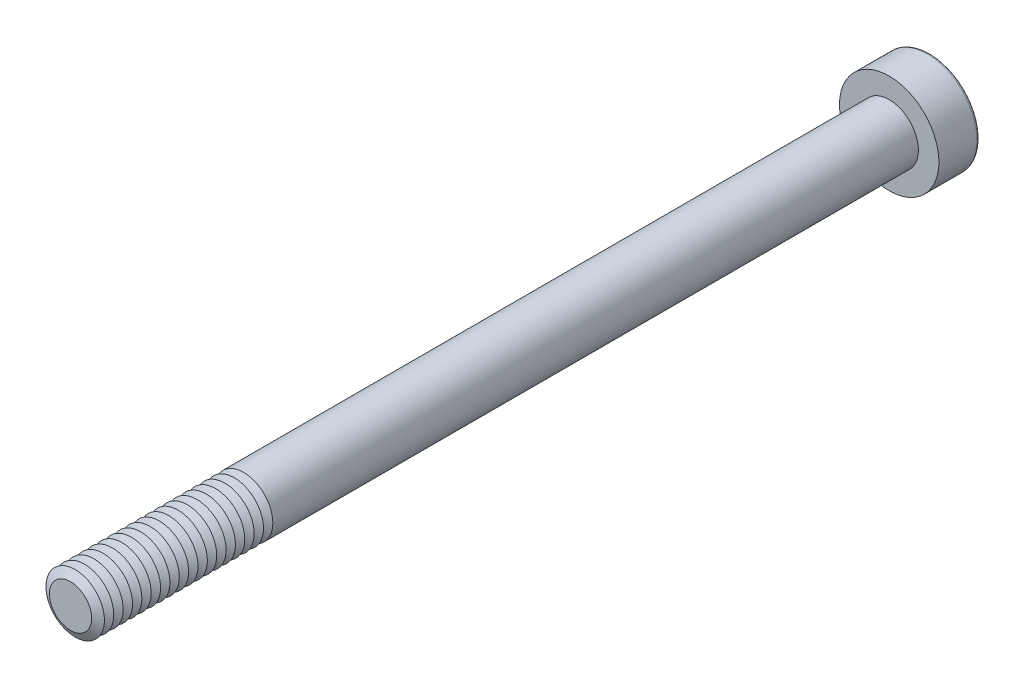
ISO-10303-21;
HEADER;
FILE_DESCRIPTION(('STEP AP214'),'2;1');
FILE_NAME('part.step','',(''),(''),'','','');
FILE_SCHEMA(('AUTOMOTIVE_DESIGN { 1 0 10303 214 1 1 1 1 }'));
ENDSEC;
DATA;
#1=APPLICATION_CONTEXT('core data for automotive mechanical design processes');
#2=APPLICATION_PROTOCOL_DEFINITION('international standard','automotive_design',2000,#1);
#3=PRODUCT_CONTEXT('',#1,'mechanical');
#4=PRODUCT('Part','Part','',(#3));
#5=PRODUCT_RELATED_PRODUCT_CATEGORY('part','',(#4));
#6=PRODUCT_DEFINITION_FORMATION('','',#4);
#7=PRODUCT_DEFINITION_CONTEXT('part definition',#1,'design');
#8=PRODUCT_DEFINITION('design','',#6,#7);
#9=PRODUCT_DEFINITION_SHAPE('','',#8);
#10=(LENGTH_UNIT() NAMED_UNIT(*) SI_UNIT(.MILLI.,.METRE.));
#11=(NAMED_UNIT(*) PLANE_ANGLE_UNIT() SI_UNIT($,.RADIAN.));
#12=(NAMED_UNIT(*) SI_UNIT($,.STERADIAN.) SOLID_ANGLE_UNIT());
#13=UNCERTAINTY_MEASURE_WITH_UNIT(LENGTH_MEASURE(1.E-05),#10,'distance_accuracy_value','');
#14=(GEOMETRIC_REPRESENTATION_CONTEXT(3) GLOBAL_UNCERTAINTY_ASSIGNED_CONTEXT((#13)) GLOBAL_UNIT_ASSIGNED_CONTEXT((#10,
#11,#12)) REPRESENTATION_CONTEXT('',''));
#15=CARTESIAN_POINT('',(0.,0.,0.));
#16=DIRECTION('',(0.,0.,1.));
#17=DIRECTION('',(1.,0.,0.));
#18=AXIS2_PLACEMENT_3D('',#15,#16,#17);
#19=CARTESIAN_POINT('',(0.,0.,67.2));
#20=DIRECTION('',(0.,0.,1.));
#21=DIRECTION('',(1.,0.,0.));
#22=AXIS2_PLACEMENT_3D('',#19,#20,#21);
#23=CONICAL_SURFACE('',#22,2.5,1.0471975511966);
#24=CARTESIAN_POINT('',(0.,0.,66.8));
#25=DIRECTION('',(0.,0.,1.));
#26=DIRECTION('',(1.,0.,0.));
#27=AXIS2_PLACEMENT_3D('',#24,#25,#26);
#28=CIRCLE('',#27,1.80717967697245);
#29=CARTESIAN_POINT('',(1.80717967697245,0.,66.8));
#30=VERTEX_POINT('',#29);
#31=EDGE_CURVE('E314',#30,#30,#28,.T.);
#32=ORIENTED_EDGE('',*,*,#31,.T.);
#33=EDGE_LOOP('',(#32));
#34=FACE_BOUND('',#33,.T.);
#35=CARTESIAN_POINT('',(0.,0.,67.2));
#36=DIRECTION('',(0.,0.,1.));
#37=DIRECTION('',(1.,0.,0.));
#38=AXIS2_PLACEMENT_3D('',#35,#36,#37);
#39=CIRCLE('',#38,2.5);
#40=CARTESIAN_POINT('',(2.5,0.,67.2));
#41=VERTEX_POINT('',#40);
#42=EDGE_CURVE('E317',#41,#41,#39,.T.);
#43=ORIENTED_EDGE('',*,*,#42,.F.);
#44=EDGE_LOOP('',(#43));
#45=FACE_BOUND('',#44,.T.);
#46=ADVANCED_FACE('F39',(#34,#45),#23,.T.);
#47=CARTESIAN_POINT('',(0.,0.,66.8));
#48=DIRECTION('',(0.,0.,-1.));
#49=DIRECTION('',(-1.,0.,0.));
#50=AXIS2_PLACEMENT_3D('',#47,#48,#49);
#51=CONICAL_SURFACE('',#50,1.80717967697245,1.0471975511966);
#52=CARTESIAN_POINT('',(0.,0.,66.4));
#53=DIRECTION('',(0.,0.,1.));
#54=DIRECTION('',(1.,0.,0.));
#55=AXIS2_PLACEMENT_3D('',#52,#53,#54);
#56=CIRCLE('',#55,2.5);
#57=CARTESIAN_POINT('',(2.5,0.,66.4));
#58=VERTEX_POINT('',#57);
#59=EDGE_CURVE('E325',#58,#58,#56,.T.);
#60=ORIENTED_EDGE('',*,*,#59,.T.);
#61=EDGE_LOOP('',(#60));
#62=FACE_BOUND('',#61,.T.);
#63=ORIENTED_EDGE('',*,*,#31,.F.);
#64=EDGE_LOOP('',(#63));
#65=FACE_BOUND('',#64,.T.);
#66=ADVANCED_FACE('F245',(#62,#65),#51,.T.);
#67=CARTESIAN_POINT('',(0.,0.,70.));
#68=DIRECTION('',(0.,0.,1.));
#69=DIRECTION('',(1.,0.,0.));
#70=AXIS2_PLACEMENT_3D('',#67,#68,#69);
#71=PLANE('',#70);
#72=CARTESIAN_POINT('',(0.,0.,70.));
#73=DIRECTION('',(0.,0.,1.));
#74=DIRECTION('',(1.,0.,0.));
#75=AXIS2_PLACEMENT_3D('',#72,#73,#74);
#76=CIRCLE('',#75,1.80717967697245);
#77=CARTESIAN_POINT('',(1.80717967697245,0.,70.));
#78=VERTEX_POINT('',#77);
#79=EDGE_CURVE('E174',#78,#78,#76,.T.);
#80=ORIENTED_EDGE('',*,*,#79,.T.);
#81=EDGE_LOOP('',(#80));
#82=FACE_BOUND('',#81,.T.);
#83=ADVANCED_FACE('F251',(#82),#71,.T.);
#84=CARTESIAN_POINT('',(0.,0.,70.));
#85=DIRECTION('',(0.,0.,-1.));
#86=DIRECTION('',(-1.,0.,0.));
#87=AXIS2_PLACEMENT_3D('',#84,#85,#86);
#88=CONICAL_SURFACE('',#87,1.80717967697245,1.0471975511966);
#89=CARTESIAN_POINT('',(0.,0.,69.6));
#90=DIRECTION('',(0.,0.,1.));
#91=DIRECTION('',(1.,0.,0.));
#92=AXIS2_PLACEMENT_3D('',#89,#90,#91);
#93=CIRCLE('',#92,2.5);
#94=CARTESIAN_POINT('',(2.5,0.,69.6));
#95=VERTEX_POINT('',#94);
#96=EDGE_CURVE('E291',#95,#95,#93,.T.);
#97=ORIENTED_EDGE('',*,*,#96,.T.);
#98=EDGE_LOOP('',(#97));
#99=FACE_BOUND('',#98,.T.);
#100=ORIENTED_EDGE('',*,*,#79,.F.);
#101=EDGE_LOOP('',(#100));
#102=FACE_BOUND('',#101,.T.);
#103=ADVANCED_FACE('F199',(#99,#102),#88,.T.);
#104=CARTESIAN_POINT('',(0.,0.,69.6));
#105=DIRECTION('',(0.,0.,1.));
#106=DIRECTION('',(1.,0.,0.));
#107=AXIS2_PLACEMENT_3D('',#104,#105,#106);
#108=CONICAL_SURFACE('',#107,2.5,1.0471975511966);
#109=CARTESIAN_POINT('',(0.,0.,69.2));
#110=DIRECTION('',(0.,0.,1.));
#111=DIRECTION('',(1.,0.,0.));
#112=AXIS2_PLACEMENT_3D('',#109,#110,#111);
#113=CIRCLE('',#112,1.80717967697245);
#114=CARTESIAN_POINT('',(1.80717967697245,0.,69.2));
#115=VERTEX_POINT('',#114);
#116=EDGE_CURVE('E288',#115,#115,#113,.T.);
#117=ORIENTED_EDGE('',*,*,#116,.T.);
#118=EDGE_LOOP('',(#117));
#119=FACE_BOUND('',#118,.T.);
#120=ORIENTED_EDGE('',*,*,#96,.F.);
#121=EDGE_LOOP('',(#120));
#122=FACE_BOUND('',#121,.T.);
#123=ADVANCED_FACE('F277',(#119,#122),#108,.T.);
#124=CARTESIAN_POINT('',(0.,0.,69.2));
#125=DIRECTION('',(0.,0.,-1.));
#126=DIRECTION('',(-1.,0.,0.));
#127=AXIS2_PLACEMENT_3D('',#124,#125,#126);
#128=CONICAL_SURFACE('',#127,1.80717967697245,1.0471975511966);
#129=CARTESIAN_POINT('',(0.,0.,68.8));
#130=DIRECTION('',(0.,0.,1.));
#131=DIRECTION('',(1.,0.,0.));
#132=AXIS2_PLACEMENT_3D('',#129,#130,#131);
#133=CIRCLE('',#132,2.5);
#134=CARTESIAN_POINT('',(2.5,0.,68.8));
#135=VERTEX_POINT('',#134);
#136=EDGE_CURVE('E300',#135,#135,#133,.T.);
#137=ORIENTED_EDGE('',*,*,#136,.T.);
#138=EDGE_LOOP('',(#137));
#139=FACE_BOUND('',#138,.T.);
#140=ORIENTED_EDGE('',*,*,#116,.F.);
#141=EDGE_LOOP('',(#140));
#142=FACE_BOUND('',#141,.T.);
#143=ADVANCED_FACE('F274',(#139,#142),#128,.T.);
#144=CARTESIAN_POINT('',(0.,0.,68.8));
#145=DIRECTION('',(0.,0.,1.));
#146=DIRECTION('',(1.,0.,0.));
#147=AXIS2_PLACEMENT_3D('',#144,#145,#146);
#148=CONICAL_SURFACE('',#147,2.5,1.0471975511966);
#149=CARTESIAN_POINT('',(0.,0.,68.4));
#150=DIRECTION('',(0.,0.,1.));
#151=DIRECTION('',(1.,0.,0.));
#152=AXIS2_PLACEMENT_3D('',#149,#150,#151);
#153=CIRCLE('',#152,1.80717967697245);
#154=CARTESIAN_POINT('',(1.80717967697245,0.,68.4));
#155=VERTEX_POINT('',#154);
#156=EDGE_CURVE('E293',#155,#155,#153,.T.);
#157=ORIENTED_EDGE('',*,*,#156,.T.);
#158=EDGE_LOOP('',(#157));
#159=FACE_BOUND('',#158,.T.);
#160=ORIENTED_EDGE('',*,*,#136,.F.);
#161=EDGE_LOOP('',(#160));
#162=FACE_BOUND('',#161,.T.);
#163=ADVANCED_FACE('F270',(#159,#162),#148,.T.);
#164=CARTESIAN_POINT('',(0.,0.,68.4));
#165=DIRECTION('',(0.,0.,-1.));
#166=DIRECTION('',(-1.,0.,0.));
#167=AXIS2_PLACEMENT_3D('',#164,#165,#166);
#168=CONICAL_SURFACE('',#167,1.80717967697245,1.0471975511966);
#169=CARTESIAN_POINT('',(0.,0.,68.));
#170=DIRECTION('',(0.,0.,1.));
#171=DIRECTION('',(1.,0.,0.));
#172=AXIS2_PLACEMENT_3D('',#169,#170,#171);
#173=CIRCLE('',#172,2.5);
#174=CARTESIAN_POINT('',(2.5,0.,68.));
#175=VERTEX_POINT('',#174);
#176=EDGE_CURVE('E310',#175,#175,#173,.T.);
#177=ORIENTED_EDGE('',*,*,#176,.T.);
#178=EDGE_LOOP('',(#177));
#179=FACE_BOUND('',#178,.T.);
#180=ORIENTED_EDGE('',*,*,#156,.F.);
#181=EDGE_LOOP('',(#180));
#182=FACE_BOUND('',#181,.T.);
#183=ADVANCED_FACE('F266',(#179,#182),#168,.T.);
#184=CARTESIAN_POINT('',(0.,0.,68.));
#185=DIRECTION('',(0.,0.,1.));
#186=DIRECTION('',(1.,0.,0.));
#187=AXIS2_PLACEMENT_3D('',#184,#185,#186);
#188=CONICAL_SURFACE('',#187,2.5,1.0471975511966);
#189=CARTESIAN_POINT('',(0.,0.,67.6));
#190=DIRECTION('',(0.,0.,1.));
#191=DIRECTION('',(1.,0.,0.));
#192=AXIS2_PLACEMENT_3D('',#189,#190,#191);
#193=CIRCLE('',#192,1.80717967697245);
#194=CARTESIAN_POINT('',(1.80717967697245,0.,67.6));
#195=VERTEX_POINT('',#194);
#196=EDGE_CURVE('E306',#195,#195,#193,.T.);
#197=ORIENTED_EDGE('',*,*,#196,.T.);
#198=EDGE_LOOP('',(#197));
#199=FACE_BOUND('',#198,.T.);
#200=ORIENTED_EDGE('',*,*,#176,.F.);
#201=EDGE_LOOP('',(#200));
#202=FACE_BOUND('',#201,.T.);
#203=ADVANCED_FACE('F262',(#199,#202),#188,.T.);
#204=CARTESIAN_POINT('',(0.,0.,67.6));
#205=DIRECTION('',(0.,0.,-1.));
#206=DIRECTION('',(-1.,0.,0.));
#207=AXIS2_PLACEMENT_3D('',#204,#205,#206);
#208=CONICAL_SURFACE('',#207,1.80717967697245,1.0471975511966);
#209=ORIENTED_EDGE('',*,*,#42,.T.);
#210=EDGE_LOOP('',(#209));
#211=FACE_BOUND('',#210,.T.);
#212=ORIENTED_EDGE('',*,*,#196,.F.);
#213=EDGE_LOOP('',(#212));
#214=FACE_BOUND('',#213,.T.);
#215=ADVANCED_FACE('F258',(#211,#214),#208,.T.);
#216=CARTESIAN_POINT('',(0.,0.,66.4));
#217=DIRECTION('',(0.,0.,1.));
#218=DIRECTION('',(1.,0.,0.));
#219=AXIS2_PLACEMENT_3D('',#216,#217,#218);
#220=CONICAL_SURFACE('',#219,2.5,1.0471975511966);
#221=CARTESIAN_POINT('',(0.,0.,66.));
#222=DIRECTION('',(0.,0.,1.));
#223=DIRECTION('',(1.,0.,0.));
#224=AXIS2_PLACEMENT_3D('',#221,#222,#223);
#225=CIRCLE('',#224,1.80717967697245);
#226=CARTESIAN_POINT('',(1.80717967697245,0.,66.));
#227=VERTEX_POINT('',#226);
#228=EDGE_CURVE('E321',#227,#227,#225,.T.);
#229=ORIENTED_EDGE('',*,*,#228,.T.);
#230=EDGE_LOOP('',(#229));
#231=FACE_BOUND('',#230,.T.);
#232=ORIENTED_EDGE('',*,*,#59,.F.);
#233=EDGE_LOOP('',(#232));
#234=FACE_BOUND('',#233,.T.);
#235=ADVANCED_FACE('F261',(#231,#234),#220,.T.);
#236=CARTESIAN_POINT('',(0.,0.,66.));
#237=DIRECTION('',(0.,0.,-1.));
#238=DIRECTION('',(-1.,0.,0.));
#239=AXIS2_PLACEMENT_3D('',#236,#237,#238);
#240=CONICAL_SURFACE('',#239,1.80717967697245,1.0471975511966);
#241=CARTESIAN_POINT('',(0.,0.,65.6));
#242=DIRECTION('',(0.,0.,1.));
#243=DIRECTION('',(1.,0.,0.));
#244=AXIS2_PLACEMENT_3D('',#241,#242,#243);
#245=CIRCLE('',#244,2.5);
#246=CARTESIAN_POINT('',(2.5,0.,65.6));
#247=VERTEX_POINT('',#246);
#248=EDGE_CURVE('E333',#247,#247,#245,.T.);
#249=ORIENTED_EDGE('',*,*,#248,.T.);
#250=EDGE_LOOP('',(#249));
#251=FACE_BOUND('',#250,.T.);
#252=ORIENTED_EDGE('',*,*,#228,.F.);
#253=EDGE_LOOP('',(#252));
#254=FACE_BOUND('',#253,.T.);
#255=ADVANCED_FACE('F544',(#251,#254),#240,.T.);
#256=CARTESIAN_POINT('',(0.,0.,65.6));
#257=DIRECTION('',(0.,0.,1.));
#258=DIRECTION('',(1.,0.,0.));
#259=AXIS2_PLACEMENT_3D('',#256,#257,#258);
#260=CONICAL_SURFACE('',#259,2.5,1.0471975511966);
#261=CARTESIAN_POINT('',(0.,0.,65.2));
#262=DIRECTION('',(0.,0.,1.));
#263=DIRECTION('',(1.,0.,0.));
#264=AXIS2_PLACEMENT_3D('',#261,#262,#263);
#265=CIRCLE('',#264,1.80717967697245);
#266=CARTESIAN_POINT('',(1.80717967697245,0.,65.2));
#267=VERTEX_POINT('',#266);
#268=EDGE_CURVE('E329',#267,#267,#265,.T.);
#269=ORIENTED_EDGE('',*,*,#268,.T.);
#270=EDGE_LOOP('',(#269));
#271=FACE_BOUND('',#270,.T.);
#272=ORIENTED_EDGE('',*,*,#248,.F.);
#273=EDGE_LOOP('',(#272));
#274=FACE_BOUND('',#273,.T.);
#275=ADVANCED_FACE('F540',(#271,#274),#260,.T.);
#276=CARTESIAN_POINT('',(0.,0.,65.2));
#277=DIRECTION('',(0.,0.,-1.));
#278=DIRECTION('',(-1.,0.,0.));
#279=AXIS2_PLACEMENT_3D('',#276,#277,#278);
#280=CONICAL_SURFACE('',#279,1.80717967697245,1.0471975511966);
#281=CARTESIAN_POINT('',(0.,0.,64.8));
#282=DIRECTION('',(0.,0.,1.));
#283=DIRECTION('',(1.,0.,0.));
#284=AXIS2_PLACEMENT_3D('',#281,#282,#283);
#285=CIRCLE('',#284,2.5);
#286=CARTESIAN_POINT('',(2.5,0.,64.8));
#287=VERTEX_POINT('',#286);
#288=EDGE_CURVE('E341',#287,#287,#285,.T.);
#289=ORIENTED_EDGE('',*,*,#288,.T.);
#290=EDGE_LOOP('',(#289));
#291=FACE_BOUND('',#290,.T.);
#292=ORIENTED_EDGE('',*,*,#268,.F.);
#293=EDGE_LOOP('',(#292));
#294=FACE_BOUND('',#293,.T.);
#295=ADVANCED_FACE('F536',(#291,#294),#280,.T.);
#296=CARTESIAN_POINT('',(0.,0.,64.8));
#297=DIRECTION('',(0.,0.,1.));
#298=DIRECTION('',(1.,0.,0.));
#299=AXIS2_PLACEMENT_3D('',#296,#297,#298);
#300=CONICAL_SURFACE('',#299,2.5,1.0471975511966);
#301=CARTESIAN_POINT('',(0.,0.,64.4));
#302=DIRECTION('',(0.,0.,1.));
#303=DIRECTION('',(1.,0.,0.));
#304=AXIS2_PLACEMENT_3D('',#301,#302,#303);
#305=CIRCLE('',#304,1.80717967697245);
#306=CARTESIAN_POINT('',(1.80717967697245,0.,64.4));
#307=VERTEX_POINT('',#306);
#308=EDGE_CURVE('E337',#307,#307,#305,.T.);
#309=ORIENTED_EDGE('',*,*,#308,.T.);
#310=EDGE_LOOP('',(#309));
#311=FACE_BOUND('',#310,.T.);
#312=ORIENTED_EDGE('',*,*,#288,.F.);
#313=EDGE_LOOP('',(#312));
#314=FACE_BOUND('',#313,.T.);
#315=ADVANCED_FACE('F532',(#311,#314),#300,.T.);
#316=CARTESIAN_POINT('',(0.,0.,64.4));
#317=DIRECTION('',(0.,0.,-1.));
#318=DIRECTION('',(-1.,0.,0.));
#319=AXIS2_PLACEMENT_3D('',#316,#317,#318);
#320=CONICAL_SURFACE('',#319,1.80717967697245,1.0471975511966);
#321=CARTESIAN_POINT('',(0.,0.,64.));
#322=DIRECTION('',(0.,0.,1.));
#323=DIRECTION('',(1.,0.,0.));
#324=AXIS2_PLACEMENT_3D('',#321,#322,#323);
#325=CIRCLE('',#324,2.5);
#326=CARTESIAN_POINT('',(2.5,0.,64.));
#327=VERTEX_POINT('',#326);
#328=EDGE_CURVE('E348',#327,#327,#325,.T.);
#329=ORIENTED_EDGE('',*,*,#328,.T.);
#330=EDGE_LOOP('',(#329));
#331=FACE_BOUND('',#330,.T.);
#332=ORIENTED_EDGE('',*,*,#308,.F.);
#333=EDGE_LOOP('',(#332));
#334=FACE_BOUND('',#333,.T.);
#335=ADVANCED_FACE('F528',(#331,#334),#320,.T.);
#336=CARTESIAN_POINT('',(0.,0.,64.));
#337=DIRECTION('',(0.,0.,1.));
#338=DIRECTION('',(1.,0.,0.));
#339=AXIS2_PLACEMENT_3D('',#336,#337,#338);
#340=CONICAL_SURFACE('',#339,2.5,1.0471975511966);
#341=CARTESIAN_POINT('',(0.,0.,63.6));
#342=DIRECTION('',(0.,0.,1.));
#343=DIRECTION('',(1.,0.,0.));
#344=AXIS2_PLACEMENT_3D('',#341,#342,#343);
#345=CIRCLE('',#344,1.80717967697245);
#346=CARTESIAN_POINT('',(1.80717967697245,0.,63.6));
#347=VERTEX_POINT('',#346);
#348=EDGE_CURVE('E345',#347,#347,#345,.T.);
#349=ORIENTED_EDGE('',*,*,#348,.T.);
#350=EDGE_LOOP('',(#349));
#351=FACE_BOUND('',#350,.T.);
#352=ORIENTED_EDGE('',*,*,#328,.F.);
#353=EDGE_LOOP('',(#352));
#354=FACE_BOUND('',#353,.T.);
#355=ADVANCED_FACE('F524',(#351,#354),#340,.T.);
#356=CARTESIAN_POINT('',(0.,0.,63.6));
#357=DIRECTION('',(0.,0.,-1.));
#358=DIRECTION('',(-1.,0.,0.));
#359=AXIS2_PLACEMENT_3D('',#356,#357,#358);
#360=CONICAL_SURFACE('',#359,1.80717967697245,1.0471975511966);
#361=CARTESIAN_POINT('',(0.,0.,63.2));
#362=DIRECTION('',(0.,0.,1.));
#363=DIRECTION('',(1.,0.,0.));
#364=AXIS2_PLACEMENT_3D('',#361,#362,#363);
#365=CIRCLE('',#364,2.5);
#366=CARTESIAN_POINT('',(2.5,0.,63.2));
#367=VERTEX_POINT('',#366);
#368=EDGE_CURVE('E356',#367,#367,#365,.T.);
#369=ORIENTED_EDGE('',*,*,#368,.T.);
#370=EDGE_LOOP('',(#369));
#371=FACE_BOUND('',#370,.T.);
#372=ORIENTED_EDGE('',*,*,#348,.F.);
#373=EDGE_LOOP('',(#372));
#374=FACE_BOUND('',#373,.T.);
#375=ADVANCED_FACE('F520',(#371,#374),#360,.T.);
#376=CARTESIAN_POINT('',(0.,0.,63.2));
#377=DIRECTION('',(0.,0.,1.));
#378=DIRECTION('',(1.,0.,0.));
#379=AXIS2_PLACEMENT_3D('',#376,#377,#378);
#380=CONICAL_SURFACE('',#379,2.5,1.0471975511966);
#381=CARTESIAN_POINT('',(0.,0.,62.8));
#382=DIRECTION('',(0.,0.,1.));
#383=DIRECTION('',(1.,0.,0.));
#384=AXIS2_PLACEMENT_3D('',#381,#382,#383);
#385=CIRCLE('',#384,1.80717967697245);
#386=CARTESIAN_POINT('',(1.80717967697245,0.,62.8));
#387=VERTEX_POINT('',#386);
#388=EDGE_CURVE('E352',#387,#387,#385,.T.);
#389=ORIENTED_EDGE('',*,*,#388,.T.);
#390=EDGE_LOOP('',(#389));
#391=FACE_BOUND('',#390,.T.);
#392=ORIENTED_EDGE('',*,*,#368,.F.);
#393=EDGE_LOOP('',(#392));
#394=FACE_BOUND('',#393,.T.);
#395=ADVANCED_FACE('F516',(#391,#394),#380,.T.);
#396=CARTESIAN_POINT('',(0.,0.,62.8));
#397=DIRECTION('',(0.,0.,-1.));
#398=DIRECTION('',(-1.,0.,0.));
#399=AXIS2_PLACEMENT_3D('',#396,#397,#398);
#400=CONICAL_SURFACE('',#399,1.80717967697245,1.0471975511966);
#401=CARTESIAN_POINT('',(0.,0.,62.4));
#402=DIRECTION('',(0.,0.,1.));
#403=DIRECTION('',(1.,0.,0.));
#404=AXIS2_PLACEMENT_3D('',#401,#402,#403);
#405=CIRCLE('',#404,2.5);
#406=CARTESIAN_POINT('',(2.5,0.,62.4));
#407=VERTEX_POINT('',#406);
#408=EDGE_CURVE('E364',#407,#407,#405,.T.);
#409=ORIENTED_EDGE('',*,*,#408,.T.);
#410=EDGE_LOOP('',(#409));
#411=FACE_BOUND('',#410,.T.);
#412=ORIENTED_EDGE('',*,*,#388,.F.);
#413=EDGE_LOOP('',(#412));
#414=FACE_BOUND('',#413,.T.);
#415=ADVANCED_FACE('F512',(#411,#414),#400,.T.);
#416=CARTESIAN_POINT('',(0.,0.,62.4));
#417=DIRECTION('',(0.,0.,1.));
#418=DIRECTION('',(1.,0.,0.));
#419=AXIS2_PLACEMENT_3D('',#416,#417,#418);
#420=CONICAL_SURFACE('',#419,2.5,1.0471975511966);
#421=CARTESIAN_POINT('',(0.,0.,62.));
#422=DIRECTION('',(0.,0.,1.));
#423=DIRECTION('',(1.,0.,0.));
#424=AXIS2_PLACEMENT_3D('',#421,#422,#423);
#425=CIRCLE('',#424,1.80717967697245);
#426=CARTESIAN_POINT('',(1.80717967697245,0.,62.));
#427=VERTEX_POINT('',#426);
#428=EDGE_CURVE('E360',#427,#427,#425,.T.);
#429=ORIENTED_EDGE('',*,*,#428,.T.);
#430=EDGE_LOOP('',(#429));
#431=FACE_BOUND('',#430,.T.);
#432=ORIENTED_EDGE('',*,*,#408,.F.);
#433=EDGE_LOOP('',(#432));
#434=FACE_BOUND('',#433,.T.);
#435=ADVANCED_FACE('F508',(#431,#434),#420,.T.);
#436=CARTESIAN_POINT('',(0.,0.,62.));
#437=DIRECTION('',(0.,0.,-1.));
#438=DIRECTION('',(-1.,0.,0.));
#439=AXIS2_PLACEMENT_3D('',#436,#437,#438);
#440=CONICAL_SURFACE('',#439,1.80717967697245,1.0471975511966);
#441=CARTESIAN_POINT('',(0.,0.,61.6));
#442=DIRECTION('',(0.,0.,1.));
#443=DIRECTION('',(1.,0.,0.));
#444=AXIS2_PLACEMENT_3D('',#441,#442,#443);
#445=CIRCLE('',#444,2.5);
#446=CARTESIAN_POINT('',(2.5,0.,61.6));
#447=VERTEX_POINT('',#446);
#448=EDGE_CURVE('E372',#447,#447,#445,.T.);
#449=ORIENTED_EDGE('',*,*,#448,.T.);
#450=EDGE_LOOP('',(#449));
#451=FACE_BOUND('',#450,.T.);
#452=ORIENTED_EDGE('',*,*,#428,.F.);
#453=EDGE_LOOP('',(#452));
#454=FACE_BOUND('',#453,.T.);
#455=ADVANCED_FACE('F504',(#451,#454),#440,.T.);
#456=CARTESIAN_POINT('',(0.,0.,61.6));
#457=DIRECTION('',(0.,0.,1.));
#458=DIRECTION('',(1.,0.,0.));
#459=AXIS2_PLACEMENT_3D('',#456,#457,#458);
#460=CONICAL_SURFACE('',#459,2.5,1.0471975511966);
#461=CARTESIAN_POINT('',(0.,0.,61.2));
#462=DIRECTION('',(0.,0.,1.));
#463=DIRECTION('',(1.,0.,0.));
#464=AXIS2_PLACEMENT_3D('',#461,#462,#463);
#465=CIRCLE('',#464,1.80717967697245);
#466=CARTESIAN_POINT('',(1.80717967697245,0.,61.2));
#467=VERTEX_POINT('',#466);
#468=EDGE_CURVE('E368',#467,#467,#465,.T.);
#469=ORIENTED_EDGE('',*,*,#468,.T.);
#470=EDGE_LOOP('',(#469));
#471=FACE_BOUND('',#470,.T.);
#472=ORIENTED_EDGE('',*,*,#448,.F.);
#473=EDGE_LOOP('',(#472));
#474=FACE_BOUND('',#473,.T.);
#475=ADVANCED_FACE('F500',(#471,#474),#460,.T.);
#476=CARTESIAN_POINT('',(0.,0.,61.2));
#477=DIRECTION('',(0.,0.,-1.));
#478=DIRECTION('',(-1.,0.,0.));
#479=AXIS2_PLACEMENT_3D('',#476,#477,#478);
#480=CONICAL_SURFACE('',#479,1.80717967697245,1.0471975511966);
#481=CARTESIAN_POINT('',(0.,0.,60.8));
#482=DIRECTION('',(0.,0.,1.));
#483=DIRECTION('',(1.,0.,0.));
#484=AXIS2_PLACEMENT_3D('',#481,#482,#483);
#485=CIRCLE('',#484,2.5);
#486=CARTESIAN_POINT('',(2.5,0.,60.8));
#487=VERTEX_POINT('',#486);
#488=EDGE_CURVE('E380',#487,#487,#485,.T.);
#489=ORIENTED_EDGE('',*,*,#488,.T.);
#490=EDGE_LOOP('',(#489));
#491=FACE_BOUND('',#490,.T.);
#492=ORIENTED_EDGE('',*,*,#468,.F.);
#493=EDGE_LOOP('',(#492));
#494=FACE_BOUND('',#493,.T.);
#495=ADVANCED_FACE('F496',(#491,#494),#480,.T.);
#496=CARTESIAN_POINT('',(0.,0.,60.8));
#497=DIRECTION('',(0.,0.,1.));
#498=DIRECTION('',(1.,0.,0.));
#499=AXIS2_PLACEMENT_3D('',#496,#497,#498);
#500=CONICAL_SURFACE('',#499,2.5,1.0471975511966);
#501=CARTESIAN_POINT('',(0.,0.,60.4));
#502=DIRECTION('',(0.,0.,1.));
#503=DIRECTION('',(1.,0.,0.));
#504=AXIS2_PLACEMENT_3D('',#501,#502,#503);
#505=CIRCLE('',#504,1.80717967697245);
#506=CARTESIAN_POINT('',(1.80717967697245,0.,60.4));
#507=VERTEX_POINT('',#506);
#508=EDGE_CURVE('E376',#507,#507,#505,.T.);
#509=ORIENTED_EDGE('',*,*,#508,.T.);
#510=EDGE_LOOP('',(#509));
#511=FACE_BOUND('',#510,.T.);
#512=ORIENTED_EDGE('',*,*,#488,.F.);
#513=EDGE_LOOP('',(#512));
#514=FACE_BOUND('',#513,.T.);
#515=ADVANCED_FACE('F492',(#511,#514),#500,.T.);
#516=CARTESIAN_POINT('',(0.,0.,60.4));
#517=DIRECTION('',(0.,0.,-1.));
#518=DIRECTION('',(-1.,0.,0.));
#519=AXIS2_PLACEMENT_3D('',#516,#517,#518);
#520=CONICAL_SURFACE('',#519,1.80717967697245,1.0471975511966);
#521=CARTESIAN_POINT('',(0.,0.,60.));
#522=DIRECTION('',(0.,0.,1.));
#523=DIRECTION('',(1.,0.,0.));
#524=AXIS2_PLACEMENT_3D('',#521,#522,#523);
#525=CIRCLE('',#524,2.5);
#526=CARTESIAN_POINT('',(2.5,0.,60.));
#527=VERTEX_POINT('',#526);
#528=EDGE_CURVE('E388',#527,#527,#525,.T.);
#529=ORIENTED_EDGE('',*,*,#528,.T.);
#530=EDGE_LOOP('',(#529));
#531=FACE_BOUND('',#530,.T.);
#532=ORIENTED_EDGE('',*,*,#508,.F.);
#533=EDGE_LOOP('',(#532));
#534=FACE_BOUND('',#533,.T.);
#535=ADVANCED_FACE('F488',(#531,#534),#520,.T.);
#536=CARTESIAN_POINT('',(0.,0.,60.));
#537=DIRECTION('',(0.,0.,1.));
#538=DIRECTION('',(1.,0.,0.));
#539=AXIS2_PLACEMENT_3D('',#536,#537,#538);
#540=CONICAL_SURFACE('',#539,2.5,1.0471975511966);
#541=CARTESIAN_POINT('',(0.,0.,59.6));
#542=DIRECTION('',(0.,0.,1.));
#543=DIRECTION('',(1.,0.,0.));
#544=AXIS2_PLACEMENT_3D('',#541,#542,#543);
#545=CIRCLE('',#544,1.80717967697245);
#546=CARTESIAN_POINT('',(1.80717967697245,0.,59.6));
#547=VERTEX_POINT('',#546);
#548=EDGE_CURVE('E384',#547,#547,#545,.T.);
#549=ORIENTED_EDGE('',*,*,#548,.T.);
#550=EDGE_LOOP('',(#549));
#551=FACE_BOUND('',#550,.T.);
#552=ORIENTED_EDGE('',*,*,#528,.F.);
#553=EDGE_LOOP('',(#552));
#554=FACE_BOUND('',#553,.T.);
#555=ADVANCED_FACE('F484',(#551,#554),#540,.T.);
#556=CARTESIAN_POINT('',(0.,0.,59.6));
#557=DIRECTION('',(0.,0.,-1.));
#558=DIRECTION('',(-1.,0.,0.));
#559=AXIS2_PLACEMENT_3D('',#556,#557,#558);
#560=CONICAL_SURFACE('',#559,1.80717967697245,1.0471975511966);
#561=CARTESIAN_POINT('',(0.,0.,59.2));
#562=DIRECTION('',(0.,0.,1.));
#563=DIRECTION('',(1.,0.,0.));
#564=AXIS2_PLACEMENT_3D('',#561,#562,#563);
#565=CIRCLE('',#564,2.5);
#566=CARTESIAN_POINT('',(2.5,0.,59.2));
#567=VERTEX_POINT('',#566);
#568=EDGE_CURVE('E396',#567,#567,#565,.T.);
#569=ORIENTED_EDGE('',*,*,#568,.T.);
#570=EDGE_LOOP('',(#569));
#571=FACE_BOUND('',#570,.T.);
#572=ORIENTED_EDGE('',*,*,#548,.F.);
#573=EDGE_LOOP('',(#572));
#574=FACE_BOUND('',#573,.T.);
#575=ADVANCED_FACE('F480',(#571,#574),#560,.T.);
#576=CARTESIAN_POINT('',(0.,0.,59.2));
#577=DIRECTION('',(0.,0.,1.));
#578=DIRECTION('',(1.,0.,0.));
#579=AXIS2_PLACEMENT_3D('',#576,#577,#578);
#580=CONICAL_SURFACE('',#579,2.5,1.0471975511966);
#581=CARTESIAN_POINT('',(0.,0.,58.8));
#582=DIRECTION('',(0.,0.,1.));
#583=DIRECTION('',(1.,0.,0.));
#584=AXIS2_PLACEMENT_3D('',#581,#582,#583);
#585=CIRCLE('',#584,1.80717967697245);
#586=CARTESIAN_POINT('',(1.80717967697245,0.,58.8));
#587=VERTEX_POINT('',#586);
#588=EDGE_CURVE('E392',#587,#587,#585,.T.);
#589=ORIENTED_EDGE('',*,*,#588,.T.);
#590=EDGE_LOOP('',(#589));
#591=FACE_BOUND('',#590,.T.);
#592=ORIENTED_EDGE('',*,*,#568,.F.);
#593=EDGE_LOOP('',(#592));
#594=FACE_BOUND('',#593,.T.);
#595=ADVANCED_FACE('F476',(#591,#594),#580,.T.);
#596=CARTESIAN_POINT('',(0.,0.,58.8));
#597=DIRECTION('',(0.,0.,-1.));
#598=DIRECTION('',(-1.,0.,0.));
#599=AXIS2_PLACEMENT_3D('',#596,#597,#598);
#600=CONICAL_SURFACE('',#599,1.80717967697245,1.0471975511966);
#601=CARTESIAN_POINT('',(0.,0.,58.4));
#602=DIRECTION('',(0.,0.,1.));
#603=DIRECTION('',(1.,0.,0.));
#604=AXIS2_PLACEMENT_3D('',#601,#602,#603);
#605=CIRCLE('',#604,2.5);
#606=CARTESIAN_POINT('',(2.5,0.,58.4));
#607=VERTEX_POINT('',#606);
#608=EDGE_CURVE('E404',#607,#607,#605,.T.);
#609=ORIENTED_EDGE('',*,*,#608,.T.);
#610=EDGE_LOOP('',(#609));
#611=FACE_BOUND('',#610,.T.);
#612=ORIENTED_EDGE('',*,*,#588,.F.);
#613=EDGE_LOOP('',(#612));
#614=FACE_BOUND('',#613,.T.);
#615=ADVANCED_FACE('F472',(#611,#614),#600,.T.);
#616=CARTESIAN_POINT('',(0.,0.,58.4));
#617=DIRECTION('',(0.,0.,1.));
#618=DIRECTION('',(1.,0.,0.));
#619=AXIS2_PLACEMENT_3D('',#616,#617,#618);
#620=CONICAL_SURFACE('',#619,2.5,1.0471975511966);
#621=CARTESIAN_POINT('',(0.,0.,58.));
#622=DIRECTION('',(0.,0.,1.));
#623=DIRECTION('',(1.,0.,0.));
#624=AXIS2_PLACEMENT_3D('',#621,#622,#623);
#625=CIRCLE('',#624,1.80717967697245);
#626=CARTESIAN_POINT('',(1.80717967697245,0.,58.));
#627=VERTEX_POINT('',#626);
#628=EDGE_CURVE('E400',#627,#627,#625,.T.);
#629=ORIENTED_EDGE('',*,*,#628,.T.);
#630=EDGE_LOOP('',(#629));
#631=FACE_BOUND('',#630,.T.);
#632=ORIENTED_EDGE('',*,*,#608,.F.);
#633=EDGE_LOOP('',(#632));
#634=FACE_BOUND('',#633,.T.);
#635=ADVANCED_FACE('F468',(#631,#634),#620,.T.);
#636=CARTESIAN_POINT('',(0.,0.,58.));
#637=DIRECTION('',(0.,0.,-1.));
#638=DIRECTION('',(-1.,0.,0.));
#639=AXIS2_PLACEMENT_3D('',#636,#637,#638);
#640=CONICAL_SURFACE('',#639,1.80717967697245,1.0471975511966);
#641=CARTESIAN_POINT('',(0.,0.,57.6));
#642=DIRECTION('',(0.,0.,1.));
#643=DIRECTION('',(1.,0.,0.));
#644=AXIS2_PLACEMENT_3D('',#641,#642,#643);
#645=CIRCLE('',#644,2.5);
#646=CARTESIAN_POINT('',(2.5,0.,57.6));
#647=VERTEX_POINT('',#646);
#648=EDGE_CURVE('E412',#647,#647,#645,.T.);
#649=ORIENTED_EDGE('',*,*,#648,.T.);
#650=EDGE_LOOP('',(#649));
#651=FACE_BOUND('',#650,.T.);
#652=ORIENTED_EDGE('',*,*,#628,.F.);
#653=EDGE_LOOP('',(#652));
#654=FACE_BOUND('',#653,.T.);
#655=ADVANCED_FACE('F464',(#651,#654),#640,.T.);
#656=CARTESIAN_POINT('',(0.,0.,57.6));
#657=DIRECTION('',(0.,0.,1.));
#658=DIRECTION('',(1.,0.,0.));
#659=AXIS2_PLACEMENT_3D('',#656,#657,#658);
#660=CONICAL_SURFACE('',#659,2.5,1.0471975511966);
#661=CARTESIAN_POINT('',(0.,0.,57.2));
#662=DIRECTION('',(0.,0.,1.));
#663=DIRECTION('',(1.,0.,0.));
#664=AXIS2_PLACEMENT_3D('',#661,#662,#663);
#665=CIRCLE('',#664,1.80717967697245);
#666=CARTESIAN_POINT('',(1.80717967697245,0.,57.2));
#667=VERTEX_POINT('',#666);
#668=EDGE_CURVE('E408',#667,#667,#665,.T.);
#669=ORIENTED_EDGE('',*,*,#668,.T.);
#670=EDGE_LOOP('',(#669));
#671=FACE_BOUND('',#670,.T.);
#672=ORIENTED_EDGE('',*,*,#648,.F.);
#673=EDGE_LOOP('',(#672));
#674=FACE_BOUND('',#673,.T.);
#675=ADVANCED_FACE('F460',(#671,#674),#660,.T.);
#676=CARTESIAN_POINT('',(0.,0.,57.2));
#677=DIRECTION('',(0.,0.,-1.));
#678=DIRECTION('',(-1.,0.,0.));
#679=AXIS2_PLACEMENT_3D('',#676,#677,#678);
#680=CONICAL_SURFACE('',#679,1.80717967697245,1.0471975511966);
#681=CARTESIAN_POINT('',(0.,0.,56.8));
#682=DIRECTION('',(0.,0.,1.));
#683=DIRECTION('',(1.,0.,0.));
#684=AXIS2_PLACEMENT_3D('',#681,#682,#683);
#685=CIRCLE('',#684,2.5);
#686=CARTESIAN_POINT('',(2.5,0.,56.8));
#687=VERTEX_POINT('',#686);
#688=EDGE_CURVE('E420',#687,#687,#685,.T.);
#689=ORIENTED_EDGE('',*,*,#688,.T.);
#690=EDGE_LOOP('',(#689));
#691=FACE_BOUND('',#690,.T.);
#692=ORIENTED_EDGE('',*,*,#668,.F.);
#693=EDGE_LOOP('',(#692));
#694=FACE_BOUND('',#693,.T.);
#695=ADVANCED_FACE('F456',(#691,#694),#680,.T.);
#696=CARTESIAN_POINT('',(0.,0.,56.8));
#697=DIRECTION('',(0.,0.,1.));
#698=DIRECTION('',(1.,0.,0.));
#699=AXIS2_PLACEMENT_3D('',#696,#697,#698);
#700=CONICAL_SURFACE('',#699,2.5,1.0471975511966);
#701=CARTESIAN_POINT('',(0.,0.,56.4));
#702=DIRECTION('',(0.,0.,1.));
#703=DIRECTION('',(1.,0.,0.));
#704=AXIS2_PLACEMENT_3D('',#701,#702,#703);
#705=CIRCLE('',#704,1.80717967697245);
#706=CARTESIAN_POINT('',(1.80717967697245,0.,56.4));
#707=VERTEX_POINT('',#706);
#708=EDGE_CURVE('E416',#707,#707,#705,.T.);
#709=ORIENTED_EDGE('',*,*,#708,.T.);
#710=EDGE_LOOP('',(#709));
#711=FACE_BOUND('',#710,.T.);
#712=ORIENTED_EDGE('',*,*,#688,.F.);
#713=EDGE_LOOP('',(#712));
#714=FACE_BOUND('',#713,.T.);
#715=ADVANCED_FACE('F451',(#711,#714),#700,.T.);
#716=CARTESIAN_POINT('',(0.,0.,56.4));
#717=DIRECTION('',(0.,0.,-1.));
#718=DIRECTION('',(-1.,0.,0.));
#719=AXIS2_PLACEMENT_3D('',#716,#717,#718);
#720=CONICAL_SURFACE('',#719,1.80717967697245,1.0471975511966);
#721=CARTESIAN_POINT('',(0.,0.,56.));
#722=DIRECTION('',(0.,0.,1.));
#723=DIRECTION('',(1.,0.,0.));
#724=AXIS2_PLACEMENT_3D('',#721,#722,#723);
#725=CIRCLE('',#724,2.5);
#726=CARTESIAN_POINT('',(2.5,0.,56.));
#727=VERTEX_POINT('',#726);
#728=EDGE_CURVE('E431',#727,#727,#725,.T.);
#729=ORIENTED_EDGE('',*,*,#728,.T.);
#730=EDGE_LOOP('',(#729));
#731=FACE_BOUND('',#730,.T.);
#732=ORIENTED_EDGE('',*,*,#708,.F.);
#733=EDGE_LOOP('',(#732));
#734=FACE_BOUND('',#733,.T.);
#735=ADVANCED_FACE('F437',(#731,#734),#720,.T.);
#736=CARTESIAN_POINT('',(0.,0.,56.));
#737=DIRECTION('',(0.,0.,1.));
#738=DIRECTION('',(1.,0.,0.));
#739=AXIS2_PLACEMENT_3D('',#736,#737,#738);
#740=CONICAL_SURFACE('',#739,2.5,1.0471975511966);
#741=CARTESIAN_POINT('',(0.,0.,55.6));
#742=DIRECTION('',(0.,0.,1.));
#743=DIRECTION('',(1.,0.,0.));
#744=AXIS2_PLACEMENT_3D('',#741,#742,#743);
#745=CIRCLE('',#744,1.80717967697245);
#746=CARTESIAN_POINT('',(1.80717967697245,0.,55.6));
#747=VERTEX_POINT('',#746);
#748=EDGE_CURVE('E424',#747,#747,#745,.T.);
#749=ORIENTED_EDGE('',*,*,#748,.T.);
#750=EDGE_LOOP('',(#749));
#751=FACE_BOUND('',#750,.T.);
#752=ORIENTED_EDGE('',*,*,#728,.F.);
#753=EDGE_LOOP('',(#752));
#754=FACE_BOUND('',#753,.T.);
#755=ADVANCED_FACE('F440',(#751,#754),#740,.T.);
#756=CARTESIAN_POINT('',(0.,0.,55.6));
#757=DIRECTION('',(0.,0.,-1.));
#758=DIRECTION('',(-1.,0.,0.));
#759=AXIS2_PLACEMENT_3D('',#756,#757,#758);
#760=CONICAL_SURFACE('',#759,1.80717967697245,1.0471975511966);
#761=CARTESIAN_POINT('',(0.,0.,55.2));
#762=DIRECTION('',(0.,0.,1.));
#763=DIRECTION('',(1.,0.,0.));
#764=AXIS2_PLACEMENT_3D('',#761,#762,#763);
#765=CIRCLE('',#764,2.5);
#766=CARTESIAN_POINT('',(2.5,0.,55.2));
#767=VERTEX_POINT('',#766);
#768=EDGE_CURVE('E427',#767,#767,#765,.T.);
#769=ORIENTED_EDGE('',*,*,#768,.T.);
#770=EDGE_LOOP('',(#769));
#771=FACE_BOUND('',#770,.T.);
#772=ORIENTED_EDGE('',*,*,#748,.F.);
#773=EDGE_LOOP('',(#772));
#774=FACE_BOUND('',#773,.T.);
#775=ADVANCED_FACE('F442',(#771,#774),#760,.T.);
#776=CARTESIAN_POINT('',(0.,0.,-1.25));
#777=DIRECTION('',(0.,0.,-1.));
#778=DIRECTION('',(-1.,0.,0.));
#779=AXIS2_PLACEMENT_3D('',#776,#777,#778);
#780=CONICAL_SURFACE('',#779,1.5,1.0471975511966);
#781=CARTESIAN_POINT('',(0.,0.,-0.383974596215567));
#782=VERTEX_POINT('',#781);
#783=VERTEX_LOOP('',#782);
#784=FACE_BOUND('',#783,.T.);
#785=CARTESIAN_POINT('',(0.,0.,-1.25));
#786=DIRECTION('',(0.,0.,-1.));
#787=DIRECTION('',(-1.,0.,0.));
#788=AXIS2_PLACEMENT_3D('',#785,#786,#787);
#789=CIRCLE('',#788,1.5);
#790=CARTESIAN_POINT('',(-1.29903810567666,0.749999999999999,-1.25));
#791=VERTEX_POINT('',#790);
#792=CARTESIAN_POINT('',(0.,1.5,-1.25));
#793=VERTEX_POINT('',#792);
#794=EDGE_CURVE('E149',#791,#793,#789,.T.);
#795=ORIENTED_EDGE('',*,*,#794,.T.);
#796=CARTESIAN_POINT('',(0.,0.,-1.25));
#797=DIRECTION('',(0.,0.,-1.));
#798=DIRECTION('',(-1.,0.,0.));
#799=AXIS2_PLACEMENT_3D('',#796,#797,#798);
#800=CIRCLE('',#799,1.5);
#801=CARTESIAN_POINT('',(1.29903810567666,0.75,-1.25));
#802=VERTEX_POINT('',#801);
#803=EDGE_CURVE('E54',#793,#802,#800,.T.);
#804=ORIENTED_EDGE('',*,*,#803,.T.);
#805=CARTESIAN_POINT('',(1.29903810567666,-0.75,-1.25));
#806=VERTEX_POINT('',#805);
#807=EDGE_CURVE('E1086',#802,#806,#800,.T.);
#808=ORIENTED_EDGE('',*,*,#807,.T.);
#809=CARTESIAN_POINT('',(0.,-1.5,-1.25));
#810=VERTEX_POINT('',#809);
#811=EDGE_CURVE('E1085',#806,#810,#800,.T.);
#812=ORIENTED_EDGE('',*,*,#811,.T.);
#813=CARTESIAN_POINT('',(-1.29903810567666,-0.749999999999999,-1.25));
#814=VERTEX_POINT('',#813);
#815=EDGE_CURVE('E1079',#810,#814,#800,.T.);
#816=ORIENTED_EDGE('',*,*,#815,.T.);
#817=EDGE_CURVE('E1077',#814,#791,#800,.T.);
#818=ORIENTED_EDGE('',*,*,#817,.T.);
#819=EDGE_LOOP('',(#795,#804,#808,#812,#816,#818));
#820=FACE_BOUND('',#819,.T.);
#821=ADVANCED_FACE('F201',(#784,#820),#780,.F.);
#822=CARTESIAN_POINT('',(0.,0.,-1.25));
#823=DIRECTION('',(0.,0.,-1.));
#824=DIRECTION('',(-1.,0.,0.));
#825=AXIS2_PLACEMENT_3D('',#822,#823,#824);
#826=PLANE('',#825);
#827=ORIENTED_EDGE('',*,*,#803,.F.);
#828=DIRECTION('',(1.,0.,0.));
#829=VECTOR('',#828,1.);
#830=CARTESIAN_POINT('',(-0.866025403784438,1.5,-1.25));
#831=LINE('',#830,#829);
#832=CARTESIAN_POINT('',(0.86602540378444,1.5,-1.25));
#833=VERTEX_POINT('',#832);
#834=EDGE_CURVE('E1130',#793,#833,#831,.T.);
#835=ORIENTED_EDGE('',*,*,#834,.T.);
#836=DIRECTION('',(0.5,-0.866025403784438,0.));
#837=VECTOR('',#836,1.);
#838=CARTESIAN_POINT('',(0.86602540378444,1.5,-1.25));
#839=LINE('',#838,#837);
#840=EDGE_CURVE('E155',#833,#802,#839,.T.);
#841=ORIENTED_EDGE('',*,*,#840,.T.);
#842=EDGE_LOOP('',(#827,#835,#841));
#843=FACE_BOUND('',#842,.T.);
#844=ADVANCED_FACE('F651',(#843),#826,.T.);
#845=ORIENTED_EDGE('',*,*,#807,.F.);
#846=CARTESIAN_POINT('',(1.73205080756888,0.,-1.25));
#847=VERTEX_POINT('',#846);
#848=EDGE_CURVE('E1125',#802,#847,#839,.T.);
#849=ORIENTED_EDGE('',*,*,#848,.T.);
#850=DIRECTION('',(-0.5,-0.866025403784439,0.));
#851=VECTOR('',#850,1.);
#852=CARTESIAN_POINT('',(1.73205080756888,0.,-1.25));
#853=LINE('',#852,#851);
#854=EDGE_CURVE('E1099',#847,#806,#853,.T.);
#855=ORIENTED_EDGE('',*,*,#854,.T.);
#856=EDGE_LOOP('',(#845,#849,#855));
#857=FACE_BOUND('',#856,.T.);
#858=ADVANCED_FACE('F661',(#857),#826,.T.);
#859=ORIENTED_EDGE('',*,*,#811,.F.);
#860=CARTESIAN_POINT('',(0.86602540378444,-1.5,-1.25));
#861=VERTEX_POINT('',#860);
#862=EDGE_CURVE('E1101',#806,#861,#853,.T.);
#863=ORIENTED_EDGE('',*,*,#862,.T.);
#864=DIRECTION('',(-1.,0.,0.));
#865=VECTOR('',#864,1.);
#866=CARTESIAN_POINT('',(0.86602540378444,-1.5,-1.25));
#867=LINE('',#866,#865);
#868=EDGE_CURVE('E1051',#861,#810,#867,.T.);
#869=ORIENTED_EDGE('',*,*,#868,.T.);
#870=EDGE_LOOP('',(#859,#863,#869));
#871=FACE_BOUND('',#870,.T.);
#872=ADVANCED_FACE('F671',(#871),#826,.T.);
#873=ORIENTED_EDGE('',*,*,#815,.F.);
#874=CARTESIAN_POINT('',(-0.866025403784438,-1.5,-1.25));
#875=VERTEX_POINT('',#874);
#876=EDGE_CURVE('E1095',#810,#875,#867,.T.);
#877=ORIENTED_EDGE('',*,*,#876,.T.);
#878=DIRECTION('',(-0.5,0.866025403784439,0.));
#879=VECTOR('',#878,1.);
#880=CARTESIAN_POINT('',(-0.866025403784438,-1.5,-1.25));
#881=LINE('',#880,#879);
#882=EDGE_CURVE('E1097',#875,#814,#881,.T.);
#883=ORIENTED_EDGE('',*,*,#882,.T.);
#884=EDGE_LOOP('',(#873,#877,#883));
#885=FACE_BOUND('',#884,.T.);
#886=ADVANCED_FACE('F679',(#885),#826,.T.);
#887=ORIENTED_EDGE('',*,*,#817,.F.);
#888=CARTESIAN_POINT('',(-1.73205080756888,0.,-1.25));
#889=VERTEX_POINT('',#888);
#890=EDGE_CURVE('E1103',#814,#889,#881,.T.);
#891=ORIENTED_EDGE('',*,*,#890,.T.);
#892=DIRECTION('',(0.5,0.866025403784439,0.));
#893=VECTOR('',#892,1.);
#894=CARTESIAN_POINT('',(-1.73205080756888,0.,-1.25));
#895=LINE('',#894,#893);
#896=EDGE_CURVE('E158',#889,#791,#895,.T.);
#897=ORIENTED_EDGE('',*,*,#896,.T.);
#898=EDGE_LOOP('',(#887,#891,#897));
#899=FACE_BOUND('',#898,.T.);
#900=ADVANCED_FACE('F231',(#899),#826,.T.);
#901=ORIENTED_EDGE('',*,*,#794,.F.);
#902=CARTESIAN_POINT('',(-0.866025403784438,1.5,-1.25));
#903=VERTEX_POINT('',#902);
#904=EDGE_CURVE('E1110',#791,#903,#895,.T.);
#905=ORIENTED_EDGE('',*,*,#904,.T.);
#906=EDGE_CURVE('E1126',#903,#793,#831,.T.);
#907=ORIENTED_EDGE('',*,*,#906,.T.);
#908=EDGE_LOOP('',(#901,#905,#907));
#909=FACE_BOUND('',#908,.T.);
#910=ADVANCED_FACE('F663',(#909),#826,.T.);
#911=CARTESIAN_POINT('',(-0.866025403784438,1.5,-1.25));
#912=DIRECTION('',(0.,1.,0.));
#913=DIRECTION('',(-1.,0.,0.));
#914=AXIS2_PLACEMENT_3D('',#911,#912,#913);
#915=PLANE('',#914);
#916=DIRECTION('',(0.,0.,-1.));
#917=VECTOR('',#916,1.);
#918=CARTESIAN_POINT('',(-0.866025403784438,1.5,-1.25));
#919=LINE('',#918,#917);
#920=CARTESIAN_POINT('',(-0.866025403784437,1.5,-3.5));
#921=VERTEX_POINT('',#920);
#922=EDGE_CURVE('E147',#903,#921,#919,.T.);
#923=ORIENTED_EDGE('',*,*,#922,.T.);
#924=CARTESIAN_POINT('',(-2.26080568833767,1.5,-3.76288767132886));
#925=CARTESIAN_POINT('',(-2.19307335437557,1.5,-3.74776718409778));
#926=CARTESIAN_POINT('',(-2.12529797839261,1.5,-3.73283936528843));
#927=CARTESIAN_POINT('',(-1.989639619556,1.5,-3.7034664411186));
#928=CARTESIAN_POINT('',(-1.92175663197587,1.5,-3.6890213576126));
#929=CARTESIAN_POINT('',(-1.71778516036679,1.5,-3.6465295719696));
#930=CARTESIAN_POINT('',(-1.58151166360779,1.5,-3.61935744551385));
#931=CARTESIAN_POINT('',(-1.30947840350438,1.5,-3.56878855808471));
#932=CARTESIAN_POINT('',(-1.17372447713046,1.5,-3.54536102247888));
#933=CARTESIAN_POINT('',(-0.90140428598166,1.5,-3.50385032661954));
#934=CARTESIAN_POINT('',(-0.764838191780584,1.5,-3.48576608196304));
#935=CARTESIAN_POINT('',(-0.489293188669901,1.5,-3.45729203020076));
#936=CARTESIAN_POINT('',(-0.350304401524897,1.5,-3.44699084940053));
#937=CARTESIAN_POINT('',(-0.14157144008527,1.5,-3.43918165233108));
#938=CARTESIAN_POINT('',(-0.0719628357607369,1.5,-3.43785196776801));
#939=CARTESIAN_POINT('',(0.0672555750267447,1.5,-3.43779336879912));
#940=CARTESIAN_POINT('',(0.136865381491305,1.5,-3.43906445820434));
#941=CARTESIAN_POINT('',(0.346114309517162,1.5,-3.44672257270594));
#942=CARTESIAN_POINT('',(0.48561964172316,1.5,-3.45697478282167));
#943=CARTESIAN_POINT('',(0.76382969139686,1.5,-3.48560011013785));
#944=CARTESIAN_POINT('',(0.902533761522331,1.5,-3.50397905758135));
#945=CARTESIAN_POINT('',(1.18270277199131,1.5,-3.54677522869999));
#946=CARTESIAN_POINT('',(1.32414472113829,1.5,-3.57133816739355));
#947=CARTESIAN_POINT('',(1.60634089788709,1.5,-3.62417713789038));
#948=CARTESIAN_POINT('',(1.74709501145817,1.5,-3.65245376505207));
#949=CARTESIAN_POINT('',(2.02813527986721,1.5,-3.71141289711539));
#950=CARTESIAN_POINT('',(2.16842128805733,1.5,-3.74209609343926));
#951=CARTESIAN_POINT('',(2.44863558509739,1.5,-3.80505759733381));
#952=CARTESIAN_POINT('',(2.5885638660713,1.5,-3.8373359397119));
#953=CARTESIAN_POINT('',(2.86645602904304,1.5,-3.90258693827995));
#954=CARTESIAN_POINT('',(3.0044230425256,1.5,-3.93554631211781));
#955=CARTESIAN_POINT('',(3.28017563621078,1.5,-4.00222717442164));
#956=CARTESIAN_POINT('',(3.41796121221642,1.5,-4.03594868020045));
#957=CARTESIAN_POINT('',(3.69320305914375,1.5,-4.10389962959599));
#958=CARTESIAN_POINT('',(3.83065952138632,1.5,-4.13812829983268));
#959=CARTESIAN_POINT('',(4.10546119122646,1.5,-4.20700872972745));
#960=CARTESIAN_POINT('',(4.24280640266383,1.5,-4.2416604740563));
#961=CARTESIAN_POINT('',(4.38011382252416,1.5,-4.27645965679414));
#962=B_SPLINE_CURVE_WITH_KNOTS('',3,(#924,#925,#926,#927,#928,#929,#930,#931,#932,#933,#934,
#935,#936,#937,#938,#939,#940,#941,#942,#943,#944,#945,#946,#947,#948,#949,#950,#951,#952,#953,
#954,#955,#956,#957,#958,#959,#960,#961),.UNSPECIFIED.,.F.,.F.,(4,2,2,2,2,2,2,2,2,2,2,2,2,2,2,2,
2,2,4),(0.,0.208198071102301,0.416405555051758,0.833243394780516,1.2464565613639,
1.65958581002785,2.07735129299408,2.28617008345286,2.49498917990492,2.91428402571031,
3.33388016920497,3.76448033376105,4.19514961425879,4.62594308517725,5.05674596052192,
5.48229088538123,5.90784548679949,6.33280701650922,6.75775319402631),.UNSPECIFIED.);
#963=CARTESIAN_POINT('',(0.866025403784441,1.5,-3.5));
#964=VERTEX_POINT('',#963);
#965=EDGE_CURVE('E124',#921,#964,#962,.T.);
#966=ORIENTED_EDGE('',*,*,#965,.T.);
#967=DIRECTION('',(0.,0.,-1.));
#968=VECTOR('',#967,1.);
#969=CARTESIAN_POINT('',(0.86602540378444,1.5,-1.25));
#970=LINE('',#969,#968);
#971=EDGE_CURVE('E143',#833,#964,#970,.T.);
#972=ORIENTED_EDGE('',*,*,#971,.F.);
#973=ORIENTED_EDGE('',*,*,#834,.F.);
#974=ORIENTED_EDGE('',*,*,#906,.F.);
#975=EDGE_LOOP('',(#923,#966,#972,#973,#974));
#976=FACE_BOUND('',#975,.T.);
#977=ADVANCED_FACE('F141',(#976),#915,.F.);
#978=CARTESIAN_POINT('',(0.86602540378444,1.5,-1.25));
#979=DIRECTION('',(0.866025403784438,0.5,0.));
#980=DIRECTION('',(-0.5,0.866025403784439,0.));
#981=AXIS2_PLACEMENT_3D('',#978,#979,#980);
#982=PLANE('',#981);
#983=ORIENTED_EDGE('',*,*,#971,.T.);
#984=CARTESIAN_POINT('',(0.865909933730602,1.5002,-3.50003094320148));
#985=CARTESIAN_POINT('',(0.901883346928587,1.43789222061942,-3.49038632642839));
#986=CARTESIAN_POINT('',(0.937921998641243,1.37547144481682,-3.48163049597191));
#987=CARTESIAN_POINT('',(1.01012661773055,1.25040937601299,-3.46624719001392));
#988=CARTESIAN_POINT('',(1.04629263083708,1.18776800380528,-3.4596205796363));
#989=CARTESIAN_POINT('',(1.11853262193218,1.06264466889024,-3.44888268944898));
#990=CARTESIAN_POINT('',(1.15460611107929,1.00016355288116,-3.44475860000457));
#991=CARTESIAN_POINT('',(1.22679910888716,0.875121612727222,-3.43922860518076));
#992=CARTESIAN_POINT('',(1.26291860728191,0.812560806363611,-3.43782217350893));
#993=CARTESIAN_POINT('',(1.33515760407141,0.68743919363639,-3.43782217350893));
#994=CARTESIAN_POINT('',(1.37127710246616,0.62487838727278,-3.43922860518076));
#995=CARTESIAN_POINT('',(1.44347010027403,0.49983644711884,-3.44475860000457));
#996=CARTESIAN_POINT('',(1.47954358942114,0.437355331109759,-3.44888268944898));
#997=CARTESIAN_POINT('',(1.55178358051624,0.312231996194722,-3.4596205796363));
#998=CARTESIAN_POINT('',(1.58794959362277,0.249590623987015,-3.46624719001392));
#999=CARTESIAN_POINT('',(1.66015421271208,0.124528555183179,-3.48163049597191));
#1000=CARTESIAN_POINT('',(1.69619286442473,0.0621077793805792,-3.49038632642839));
#1001=CARTESIAN_POINT('',(1.73216627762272,-0.000199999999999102,-3.50003094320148));
#1002=B_SPLINE_CURVE_WITH_KNOTS('',3,(#984,#985,#986,#987,#988,#989,#990,#991,#992,#993,#994,
#995,#996,#997,#998,#999,#1000,#1001),.UNSPECIFIED.,.F.,.F.,(4,2,2,2,2,2,2,2,4),(0.,
0.217782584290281,0.435653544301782,0.652399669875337,0.869103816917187,1.08580796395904,
1.30255408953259,1.52042504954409,1.73820763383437),.UNSPECIFIED.);
#1003=CARTESIAN_POINT('',(1.73205080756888,0.,-3.5));
#1004=VERTEX_POINT('',#1003);
#1005=EDGE_CURVE('E11',#964,#1004,#1002,.T.);
#1006=ORIENTED_EDGE('',*,*,#1005,.T.);
#1007=DIRECTION('',(0.,0.,-1.));
#1008=VECTOR('',#1007,1.);
#1009=CARTESIAN_POINT('',(1.73205080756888,0.,-1.25));
#1010=LINE('',#1009,#1008);
#1011=EDGE_CURVE('E157',#847,#1004,#1010,.T.);
#1012=ORIENTED_EDGE('',*,*,#1011,.F.);
#1013=ORIENTED_EDGE('',*,*,#848,.F.);
#1014=ORIENTED_EDGE('',*,*,#840,.F.);
#1015=EDGE_LOOP('',(#983,#1006,#1012,#1013,#1014));
#1016=FACE_BOUND('',#1015,.T.);
#1017=ADVANCED_FACE('F152',(#1016),#982,.F.);
#1018=CARTESIAN_POINT('',(1.73205080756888,0.,-1.25));
#1019=DIRECTION('',(0.866025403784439,-0.5,0.));
#1020=DIRECTION('',(0.5,0.866025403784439,0.));
#1021=AXIS2_PLACEMENT_3D('',#1018,#1019,#1020);
#1022=PLANE('',#1021);
#1023=ORIENTED_EDGE('',*,*,#1011,.T.);
#1024=CARTESIAN_POINT('',(1.73216627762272,0.000200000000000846,-3.50003094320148));
#1025=CARTESIAN_POINT('',(1.69619286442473,-0.0621077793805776,-3.49038632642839));
#1026=CARTESIAN_POINT('',(1.66015421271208,-0.124528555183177,-3.48163049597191));
#1027=CARTESIAN_POINT('',(1.58794959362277,-0.249590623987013,-3.46624719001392));
#1028=CARTESIAN_POINT('',(1.55178358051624,-0.312231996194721,-3.4596205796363));
#1029=CARTESIAN_POINT('',(1.47954358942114,-0.437355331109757,-3.44888268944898));
#1030=CARTESIAN_POINT('',(1.44347010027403,-0.499836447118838,-3.44475860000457));
#1031=CARTESIAN_POINT('',(1.37127710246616,-0.624878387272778,-3.43922860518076));
#1032=CARTESIAN_POINT('',(1.33515760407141,-0.687439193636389,-3.43782217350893));
#1033=CARTESIAN_POINT('',(1.26291860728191,-0.81256080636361,-3.43782217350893));
#1034=CARTESIAN_POINT('',(1.22679910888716,-0.87512161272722,-3.43922860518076));
#1035=CARTESIAN_POINT('',(1.15460611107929,-1.00016355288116,-3.44475860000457));
#1036=CARTESIAN_POINT('',(1.11853262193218,-1.06264466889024,-3.44888268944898));
#1037=CARTESIAN_POINT('',(1.04629263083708,-1.18776800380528,-3.4596205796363));
#1038=CARTESIAN_POINT('',(1.01012661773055,-1.25040937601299,-3.46624719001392));
#1039=CARTESIAN_POINT('',(0.937921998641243,-1.37547144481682,-3.48163049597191));
#1040=CARTESIAN_POINT('',(0.901883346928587,-1.43789222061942,-3.49038632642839));
#1041=CARTESIAN_POINT('',(0.865909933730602,-1.5002,-3.50003094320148));
#1042=B_SPLINE_CURVE_WITH_KNOTS('',3,(#1024,#1025,#1026,#1027,#1028,#1029,#1030,#1031,#1032,
#1033,#1034,#1035,#1036,#1037,#1038,#1039,#1040,#1041),.UNSPECIFIED.,.F.,.F.,(4,2,2,2,2,2,2,2,
4),(0.,0.217782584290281,0.435653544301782,0.652399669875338,0.869103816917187,1.08580796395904,
1.30255408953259,1.52042504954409,1.73820763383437),.UNSPECIFIED.);
#1043=CARTESIAN_POINT('',(0.86602540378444,-1.5,-3.5));
#1044=VERTEX_POINT('',#1043);
#1045=EDGE_CURVE('E173',#1004,#1044,#1042,.T.);
#1046=ORIENTED_EDGE('',*,*,#1045,.T.);
#1047=DIRECTION('',(0.,0.,-1.));
#1048=VECTOR('',#1047,1.);
#1049=CARTESIAN_POINT('',(0.86602540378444,-1.5,-1.25));
#1050=LINE('',#1049,#1048);
#1051=EDGE_CURVE('E1046',#861,#1044,#1050,.T.);
#1052=ORIENTED_EDGE('',*,*,#1051,.F.);
#1053=ORIENTED_EDGE('',*,*,#862,.F.);
#1054=ORIENTED_EDGE('',*,*,#854,.F.);
#1055=EDGE_LOOP('',(#1023,#1046,#1052,#1053,#1054));
#1056=FACE_BOUND('',#1055,.T.);
#1057=ADVANCED_FACE('F191',(#1056),#1022,.F.);
#1058=CARTESIAN_POINT('',(0.86602540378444,-1.5,-1.25));
#1059=DIRECTION('',(0.,-1.,0.));
#1060=DIRECTION('',(0.,0.,-1.));
#1061=AXIS2_PLACEMENT_3D('',#1058,#1059,#1060);
#1062=PLANE('',#1061);
#1063=ORIENTED_EDGE('',*,*,#1051,.T.);
#1064=CARTESIAN_POINT('',(-2.26080568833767,-1.5,-3.76288767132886));
#1065=CARTESIAN_POINT('',(-2.19307335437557,-1.5,-3.74776718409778));
#1066=CARTESIAN_POINT('',(-2.12529797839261,-1.5,-3.73283936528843));
#1067=CARTESIAN_POINT('',(-1.989639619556,-1.5,-3.7034664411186));
#1068=CARTESIAN_POINT('',(-1.92175663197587,-1.5,-3.6890213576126));
#1069=CARTESIAN_POINT('',(-1.71778516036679,-1.5,-3.6465295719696));
#1070=CARTESIAN_POINT('',(-1.58151166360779,-1.5,-3.61935744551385));
#1071=CARTESIAN_POINT('',(-1.30947840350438,-1.5,-3.56878855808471));
#1072=CARTESIAN_POINT('',(-1.17372447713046,-1.5,-3.54536102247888));
#1073=CARTESIAN_POINT('',(-0.90140428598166,-1.5,-3.50385032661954));
#1074=CARTESIAN_POINT('',(-0.764838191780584,-1.5,-3.48576608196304));
#1075=CARTESIAN_POINT('',(-0.489293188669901,-1.5,-3.45729203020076));
#1076=CARTESIAN_POINT('',(-0.350304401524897,-1.5,-3.44699084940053));
#1077=CARTESIAN_POINT('',(-0.14157144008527,-1.5,-3.43918165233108));
#1078=CARTESIAN_POINT('',(-0.0719628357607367,-1.5,-3.43785196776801));
#1079=CARTESIAN_POINT('',(0.0672555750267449,-1.5,-3.43779336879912));
#1080=CARTESIAN_POINT('',(0.136865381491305,-1.5,-3.43906445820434));
#1081=CARTESIAN_POINT('',(0.346114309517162,-1.5,-3.44672257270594));
#1082=CARTESIAN_POINT('',(0.48561964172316,-1.5,-3.45697478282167));
#1083=CARTESIAN_POINT('',(0.76382969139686,-1.5,-3.48560011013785));
#1084=CARTESIAN_POINT('',(0.902533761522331,-1.5,-3.50397905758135));
#1085=CARTESIAN_POINT('',(1.18270277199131,-1.5,-3.54677522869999));
#1086=CARTESIAN_POINT('',(1.32414472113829,-1.5,-3.57133816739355));
#1087=CARTESIAN_POINT('',(1.60634089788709,-1.5,-3.62417713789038));
#1088=CARTESIAN_POINT('',(1.74709501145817,-1.5,-3.65245376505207));
#1089=CARTESIAN_POINT('',(2.02813527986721,-1.5,-3.71141289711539));
#1090=CARTESIAN_POINT('',(2.16842128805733,-1.5,-3.74209609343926));
#1091=CARTESIAN_POINT('',(2.44863558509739,-1.5,-3.80505759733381));
#1092=CARTESIAN_POINT('',(2.5885638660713,-1.5,-3.8373359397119));
#1093=CARTESIAN_POINT('',(2.86645602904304,-1.5,-3.90258693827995));
#1094=CARTESIAN_POINT('',(3.0044230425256,-1.5,-3.93554631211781));
#1095=CARTESIAN_POINT('',(3.28017563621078,-1.5,-4.00222717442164));
#1096=CARTESIAN_POINT('',(3.41796121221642,-1.5,-4.03594868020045));
#1097=CARTESIAN_POINT('',(3.69320305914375,-1.5,-4.10389962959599));
#1098=CARTESIAN_POINT('',(3.83065952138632,-1.5,-4.13812829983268));
#1099=CARTESIAN_POINT('',(4.10546119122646,-1.5,-4.20700872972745));
#1100=CARTESIAN_POINT('',(4.24280640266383,-1.5,-4.2416604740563));
#1101=CARTESIAN_POINT('',(4.38011382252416,-1.5,-4.27645965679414));
#1102=B_SPLINE_CURVE_WITH_KNOTS('',3,(#1064,#1065,#1066,#1067,#1068,#1069,#1070,#1071,#1072,
#1073,#1074,#1075,#1076,#1077,#1078,#1079,#1080,#1081,#1082,#1083,#1084,#1085,#1086,#1087,#1088,
#1089,#1090,#1091,#1092,#1093,#1094,#1095,#1096,#1097,#1098,#1099,#1100,#1101),.UNSPECIFIED.,
.F.,.F.,(4,2,2,2,2,2,2,2,2,2,2,2,2,2,2,2,2,2,4),(0.,0.208198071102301,0.416405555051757,
0.833243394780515,1.2464565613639,1.65958581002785,2.07735129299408,2.28617008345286,
2.49498917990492,2.91428402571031,3.33388016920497,3.76448033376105,4.19514961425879,
4.62594308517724,5.05674596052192,5.48229088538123,5.90784548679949,6.33280701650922,
6.75775319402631),.UNSPECIFIED.);
#1103=CARTESIAN_POINT('',(-0.866025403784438,-1.5,-3.5));
#1104=VERTEX_POINT('',#1103);
#1105=EDGE_CURVE('E184',#1044,#1104,#1102,.F.);
#1106=ORIENTED_EDGE('',*,*,#1105,.T.);
#1107=DIRECTION('',(0.,0.,-1.));
#1108=VECTOR('',#1107,1.);
#1109=CARTESIAN_POINT('',(-0.866025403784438,-1.5,-1.25));
#1110=LINE('',#1109,#1108);
#1111=EDGE_CURVE('E1053',#875,#1104,#1110,.T.);
#1112=ORIENTED_EDGE('',*,*,#1111,.F.);
#1113=ORIENTED_EDGE('',*,*,#876,.F.);
#1114=ORIENTED_EDGE('',*,*,#868,.F.);
#1115=EDGE_LOOP('',(#1063,#1106,#1112,#1113,#1114));
#1116=FACE_BOUND('',#1115,.T.);
#1117=ADVANCED_FACE('F234',(#1116),#1062,.F.);
#1118=CARTESIAN_POINT('',(-0.866025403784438,-1.5,-1.25));
#1119=DIRECTION('',(-0.866025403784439,-0.5,0.));
#1120=DIRECTION('',(0.5,-0.866025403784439,0.));
#1121=AXIS2_PLACEMENT_3D('',#1118,#1119,#1120);
#1122=PLANE('',#1121);
#1123=ORIENTED_EDGE('',*,*,#1111,.T.);
#1124=CARTESIAN_POINT('',(-0.8659099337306,-1.5002,-3.50003094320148));
#1125=CARTESIAN_POINT('',(-0.901883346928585,-1.43789222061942,-3.49038632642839));
#1126=CARTESIAN_POINT('',(-0.937921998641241,-1.37547144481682,-3.48163049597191));
#1127=CARTESIAN_POINT('',(-1.01012661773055,-1.25040937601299,-3.46624719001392));
#1128=CARTESIAN_POINT('',(-1.04629263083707,-1.18776800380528,-3.4596205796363));
#1129=CARTESIAN_POINT('',(-1.11853262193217,-1.06264466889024,-3.44888268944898));
#1130=CARTESIAN_POINT('',(-1.15460611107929,-1.00016355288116,-3.44475860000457));
#1131=CARTESIAN_POINT('',(-1.22679910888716,-0.875121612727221,-3.43922860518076));
#1132=CARTESIAN_POINT('',(-1.26291860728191,-0.81256080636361,-3.43782217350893));
#1133=CARTESIAN_POINT('',(-1.33515760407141,-0.68743919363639,-3.43782217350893));
#1134=CARTESIAN_POINT('',(-1.37127710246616,-0.624878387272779,-3.43922860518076));
#1135=CARTESIAN_POINT('',(-1.44347010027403,-0.499836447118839,-3.44475860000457));
#1136=CARTESIAN_POINT('',(-1.47954358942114,-0.437355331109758,-3.44888268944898));
#1137=CARTESIAN_POINT('',(-1.55178358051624,-0.312231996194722,-3.4596205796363));
#1138=CARTESIAN_POINT('',(-1.58794959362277,-0.249590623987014,-3.46624719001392));
#1139=CARTESIAN_POINT('',(-1.66015421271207,-0.124528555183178,-3.48163049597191));
#1140=CARTESIAN_POINT('',(-1.69619286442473,-0.0621077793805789,-3.49038632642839));
#1141=CARTESIAN_POINT('',(-1.73216627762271,0.000199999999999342,-3.50003094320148));
#1142=B_SPLINE_CURVE_WITH_KNOTS('',3,(#1124,#1125,#1126,#1127,#1128,#1129,#1130,#1131,#1132,
#1133,#1134,#1135,#1136,#1137,#1138,#1139,#1140,#1141),.UNSPECIFIED.,.F.,.F.,(4,2,2,2,2,2,2,2,
4),(0.,0.217782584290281,0.435653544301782,0.652399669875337,0.869103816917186,1.08580796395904,
1.30255408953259,1.52042504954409,1.73820763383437),.UNSPECIFIED.);
#1143=CARTESIAN_POINT('',(-1.73205080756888,0.,-3.5));
#1144=VERTEX_POINT('',#1143);
#1145=EDGE_CURVE('E208',#1104,#1144,#1142,.T.);
#1146=ORIENTED_EDGE('',*,*,#1145,.T.);
#1147=DIRECTION('',(0.,0.,-1.));
#1148=VECTOR('',#1147,1.);
#1149=CARTESIAN_POINT('',(-1.73205080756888,0.,-1.25));
#1150=LINE('',#1149,#1148);
#1151=EDGE_CURVE('E1057',#889,#1144,#1150,.T.);
#1152=ORIENTED_EDGE('',*,*,#1151,.F.);
#1153=ORIENTED_EDGE('',*,*,#890,.F.);
#1154=ORIENTED_EDGE('',*,*,#882,.F.);
#1155=EDGE_LOOP('',(#1123,#1146,#1152,#1153,#1154));
#1156=FACE_BOUND('',#1155,.T.);
#1157=ADVANCED_FACE('F229',(#1156),#1122,.F.);
#1158=CARTESIAN_POINT('',(-1.73205080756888,0.,-1.25));
#1159=DIRECTION('',(-0.866025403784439,0.5,0.));
#1160=DIRECTION('',(-0.5,-0.866025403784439,0.));
#1161=AXIS2_PLACEMENT_3D('',#1158,#1159,#1160);
#1162=PLANE('',#1161);
#1163=ORIENTED_EDGE('',*,*,#1151,.T.);
#1164=CARTESIAN_POINT('',(-1.73216627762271,-0.000200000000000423,-3.50003094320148));
#1165=CARTESIAN_POINT('',(-1.69619286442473,0.0621077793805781,-3.49038632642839));
#1166=CARTESIAN_POINT('',(-1.66015421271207,0.124528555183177,-3.48163049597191));
#1167=CARTESIAN_POINT('',(-1.58794959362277,0.249590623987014,-3.46624719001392));
#1168=CARTESIAN_POINT('',(-1.55178358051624,0.312231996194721,-3.4596205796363));
#1169=CARTESIAN_POINT('',(-1.47954358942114,0.437355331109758,-3.44888268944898));
#1170=CARTESIAN_POINT('',(-1.44347010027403,0.499836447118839,-3.44475860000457));
#1171=CARTESIAN_POINT('',(-1.37127710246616,0.624878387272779,-3.43922860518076));
#1172=CARTESIAN_POINT('',(-1.33515760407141,0.687439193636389,-3.43782217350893));
#1173=CARTESIAN_POINT('',(-1.26291860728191,0.81256080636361,-3.43782217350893));
#1174=CARTESIAN_POINT('',(-1.22679910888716,0.875121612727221,-3.43922860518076));
#1175=CARTESIAN_POINT('',(-1.15460611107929,1.00016355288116,-3.44475860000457));
#1176=CARTESIAN_POINT('',(-1.11853262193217,1.06264466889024,-3.44888268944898));
#1177=CARTESIAN_POINT('',(-1.04629263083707,1.18776800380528,-3.4596205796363));
#1178=CARTESIAN_POINT('',(-1.01012661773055,1.25040937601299,-3.46624719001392));
#1179=CARTESIAN_POINT('',(-0.937921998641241,1.37547144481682,-3.48163049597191));
#1180=CARTESIAN_POINT('',(-0.901883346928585,1.43789222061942,-3.49038632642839));
#1181=CARTESIAN_POINT('',(-0.8659099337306,1.5002,-3.50003094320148));
#1182=B_SPLINE_CURVE_WITH_KNOTS('',3,(#1164,#1165,#1166,#1167,#1168,#1169,#1170,#1171,#1172,
#1173,#1174,#1175,#1176,#1177,#1178,#1179,#1180,#1181),.UNSPECIFIED.,.F.,.F.,(4,2,2,2,2,2,2,2,
4),(0.,0.217782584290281,0.435653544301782,0.652399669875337,0.869103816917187,1.08580796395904,
1.30255408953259,1.52042504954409,1.73820763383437),.UNSPECIFIED.);
#1183=EDGE_CURVE('E150',#1144,#921,#1182,.T.);
#1184=ORIENTED_EDGE('',*,*,#1183,.T.);
#1185=ORIENTED_EDGE('',*,*,#922,.F.);
#1186=ORIENTED_EDGE('',*,*,#904,.F.);
#1187=ORIENTED_EDGE('',*,*,#896,.F.);
#1188=EDGE_LOOP('',(#1163,#1184,#1185,#1186,#1187));
#1189=FACE_BOUND('',#1188,.T.);
#1190=ADVANCED_FACE('F197',(#1189),#1162,.F.);
#1191=CARTESIAN_POINT('',(0.,0.,-3.5));
#1192=DIRECTION('',(0.,0.,-1.));
#1193=DIRECTION('',(-1.,0.,0.));
#1194=AXIS2_PLACEMENT_3D('',#1191,#1192,#1193);
#1195=CONICAL_SURFACE('',#1194,1.73205080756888,1.30899693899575);
#1196=CARTESIAN_POINT('',(0.,0.,-3.5));
#1197=DIRECTION('',(0.,0.,-1.));
#1198=DIRECTION('',(-1.,0.,0.));
#1199=AXIS2_PLACEMENT_3D('',#1196,#1197,#1198);
#1200=CIRCLE('',#1199,1.73205080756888);
#1201=EDGE_CURVE('E120',#921,#964,#1200,.T.);
#1202=ORIENTED_EDGE('',*,*,#1201,.T.);
#1203=ORIENTED_EDGE('',*,*,#965,.F.);
#1204=EDGE_LOOP('',(#1202,#1203));
#1205=FACE_BOUND('',#1204,.T.);
#1206=ADVANCED_FACE('F122',(#1205),#1195,.F.);
#1207=EDGE_CURVE('E129',#964,#1004,#1200,.T.);
#1208=ORIENTED_EDGE('',*,*,#1207,.T.);
#1209=ORIENTED_EDGE('',*,*,#1005,.F.);
#1210=EDGE_LOOP('',(#1208,#1209));
#1211=FACE_BOUND('',#1210,.T.);
#1212=ADVANCED_FACE('F133',(#1211),#1195,.F.);
#1213=EDGE_CURVE('E164',#1004,#1044,#1200,.T.);
#1214=ORIENTED_EDGE('',*,*,#1213,.T.);
#1215=ORIENTED_EDGE('',*,*,#1045,.F.);
#1216=EDGE_LOOP('',(#1214,#1215));
#1217=FACE_BOUND('',#1216,.T.);
#1218=ADVANCED_FACE('F744',(#1217),#1195,.F.);
#1219=EDGE_CURVE('E169',#1044,#1104,#1200,.T.);
#1220=ORIENTED_EDGE('',*,*,#1219,.T.);
#1221=ORIENTED_EDGE('',*,*,#1105,.F.);
#1222=EDGE_LOOP('',(#1220,#1221));
#1223=FACE_BOUND('',#1222,.T.);
#1224=ADVANCED_FACE('F751',(#1223),#1195,.F.);
#1225=EDGE_CURVE('E67',#1104,#1144,#1200,.T.);
#1226=ORIENTED_EDGE('',*,*,#1225,.T.);
#1227=ORIENTED_EDGE('',*,*,#1145,.F.);
#1228=EDGE_LOOP('',(#1226,#1227));
#1229=FACE_BOUND('',#1228,.T.);
#1230=ADVANCED_FACE('F759',(#1229),#1195,.F.);
#1231=EDGE_CURVE('E60',#1144,#921,#1200,.T.);
#1232=ORIENTED_EDGE('',*,*,#1231,.T.);
#1233=ORIENTED_EDGE('',*,*,#1183,.F.);
#1234=EDGE_LOOP('',(#1232,#1233));
#1235=FACE_BOUND('',#1234,.T.);
#1236=ADVANCED_FACE('F198',(#1235),#1195,.F.);
#1237=CARTESIAN_POINT('',(0.,0.,-3.5));
#1238=DIRECTION('',(0.,0.,-1.));
#1239=DIRECTION('',(-1.,0.,0.));
#1240=AXIS2_PLACEMENT_3D('',#1237,#1238,#1239);
#1241=PLANE('',#1240);
#1242=ORIENTED_EDGE('',*,*,#1231,.F.);
#1243=ORIENTED_EDGE('',*,*,#1225,.F.);
#1244=ORIENTED_EDGE('',*,*,#1219,.F.);
#1245=ORIENTED_EDGE('',*,*,#1213,.F.);
#1246=ORIENTED_EDGE('',*,*,#1207,.F.);
#1247=ORIENTED_EDGE('',*,*,#1201,.F.);
#1248=EDGE_LOOP('',(#1242,#1243,#1244,#1245,#1246,#1247));
#1249=FACE_BOUND('',#1248,.T.);
#1250=CARTESIAN_POINT('',(0.,0.,-3.5));
#1251=DIRECTION('',(0.,0.,-1.));
#1252=DIRECTION('',(-1.,0.,0.));
#1253=AXIS2_PLACEMENT_3D('',#1250,#1251,#1252);
#1254=CIRCLE('',#1253,4.);
#1255=CARTESIAN_POINT('',(-4.,0.,-3.5));
#1256=VERTEX_POINT('',#1255);
#1257=EDGE_CURVE('E1071',#1256,#1256,#1254,.T.);
#1258=ORIENTED_EDGE('',*,*,#1257,.T.);
#1259=EDGE_LOOP('',(#1258));
#1260=FACE_BOUND('',#1259,.T.);
#1261=ADVANCED_FACE('F161',(#1249,#1260),#1241,.T.);
#1262=CARTESIAN_POINT('',(0.,0.,-3.25));
#1263=DIRECTION('',(0.,0.,-1.));
#1264=DIRECTION('',(-1.,0.,0.));
#1265=AXIS2_PLACEMENT_3D('',#1262,#1263,#1264);
#1266=TOROIDAL_SURFACE('',#1265,4.,0.25);
#1267=CARTESIAN_POINT('',(0.,0.,-3.25));
#1268=DIRECTION('',(0.,0.,-1.));
#1269=DIRECTION('',(-1.,0.,0.));
#1270=AXIS2_PLACEMENT_3D('',#1267,#1268,#1269);
#1271=CIRCLE('',#1270,4.25);
#1272=CARTESIAN_POINT('',(-4.25,0.,-3.25));
#1273=VERTEX_POINT('',#1272);
#1274=EDGE_CURVE('E1075',#1273,#1273,#1271,.F.);
#1275=ORIENTED_EDGE('',*,*,#1274,.F.);
#1276=EDGE_LOOP('',(#1275));
#1277=FACE_BOUND('',#1276,.T.);
#1278=ORIENTED_EDGE('',*,*,#1257,.F.);
#1279=EDGE_LOOP('',(#1278));
#1280=FACE_BOUND('',#1279,.T.);
#1281=ADVANCED_FACE('F41',(#1277,#1280),#1266,.T.);
#1282=CARTESIAN_POINT('',(0.,0.,-3.5));
#1283=DIRECTION('',(0.,0.,1.));
#1284=DIRECTION('',(1.,0.,0.));
#1285=AXIS2_PLACEMENT_3D('',#1282,#1283,#1284);
#1286=CYLINDRICAL_SURFACE('',#1285,4.25);
#1287=ORIENTED_EDGE('',*,*,#1274,.T.);
#1288=EDGE_LOOP('',(#1287));
#1289=FACE_BOUND('',#1288,.T.);
#1290=CARTESIAN_POINT('',(0.,0.,0.));
#1291=DIRECTION('',(0.,0.,-1.));
#1292=DIRECTION('',(-1.,0.,0.));
#1293=AXIS2_PLACEMENT_3D('',#1290,#1291,#1292);
#1294=CIRCLE('',#1293,4.25);
#1295=CARTESIAN_POINT('',(-4.25,0.,0.));
#1296=VERTEX_POINT('',#1295);
#1297=EDGE_CURVE('E1063',#1296,#1296,#1294,.T.);
#1298=ORIENTED_EDGE('',*,*,#1297,.T.);
#1299=EDGE_LOOP('',(#1298));
#1300=FACE_BOUND('',#1299,.T.);
#1301=ADVANCED_FACE('F783',(#1289,#1300),#1286,.T.);
#1302=CARTESIAN_POINT('',(0.,0.,0.));
#1303=DIRECTION('',(0.,0.,-1.));
#1304=DIRECTION('',(-1.,0.,0.));
#1305=AXIS2_PLACEMENT_3D('',#1302,#1303,#1304);
#1306=PLANE('',#1305);
#1307=CARTESIAN_POINT('',(0.,0.,0.));
#1308=DIRECTION('',(0.,0.,1.));
#1309=DIRECTION('',(1.,0.,0.));
#1310=AXIS2_PLACEMENT_3D('',#1307,#1308,#1309);
#1311=CIRCLE('',#1310,2.5);
#1312=CARTESIAN_POINT('',(2.5,0.,0.));
#1313=VERTEX_POINT('',#1312);
#1314=EDGE_CURVE('E1067',#1313,#1313,#1311,.T.);
#1315=ORIENTED_EDGE('',*,*,#1314,.F.);
#1316=EDGE_LOOP('',(#1315));
#1317=FACE_BOUND('',#1316,.T.);
#1318=ORIENTED_EDGE('',*,*,#1297,.F.);
#1319=EDGE_LOOP('',(#1318));
#1320=FACE_BOUND('',#1319,.T.);
#1321=ADVANCED_FACE('F791',(#1317,#1320),#1306,.F.);
#1322=CARTESIAN_POINT('',(0.,0.,70.));
#1323=DIRECTION('',(0.,0.,-1.));
#1324=DIRECTION('',(-1.,0.,0.));
#1325=AXIS2_PLACEMENT_3D('',#1322,#1323,#1324);
#1326=CYLINDRICAL_SURFACE('',#1325,2.5);
#1327=ORIENTED_EDGE('',*,*,#1314,.T.);
#1328=EDGE_LOOP('',(#1327));
#1329=FACE_BOUND('',#1328,.T.);
#1330=ORIENTED_EDGE('',*,*,#768,.F.);
#1331=EDGE_LOOP('',(#1330));
#1332=FACE_BOUND('',#1331,.T.);
#1333=ADVANCED_FACE('F800',(#1329,#1332),#1326,.T.);
#1334=CLOSED_SHELL('',(#46,#66,#83,#103,#123,#143,#163,#183,#203,#215,#235,#255,#275,#295,#315,
#335,#355,#375,#395,#415,#435,#455,#475,#495,#515,#535,#555,#575,#595,#615,#635,#655,#675,#695,
#715,#735,#755,#775,#821,#844,#858,#872,#886,#900,#910,#977,#1017,#1057,#1117,#1157,#1190,#1206,
#1212,#1218,#1224,#1230,#1236,#1261,#1281,#1301,#1321,#1333));
#1335=MANIFOLD_SOLID_BREP('B2',#1334);
#1336=ADVANCED_BREP_SHAPE_REPRESENTATION('',(#18,#1335),#14);
#1337=SHAPE_DEFINITION_REPRESENTATION(#9,#1336);
ENDSEC;
END-ISO-10303-21;
